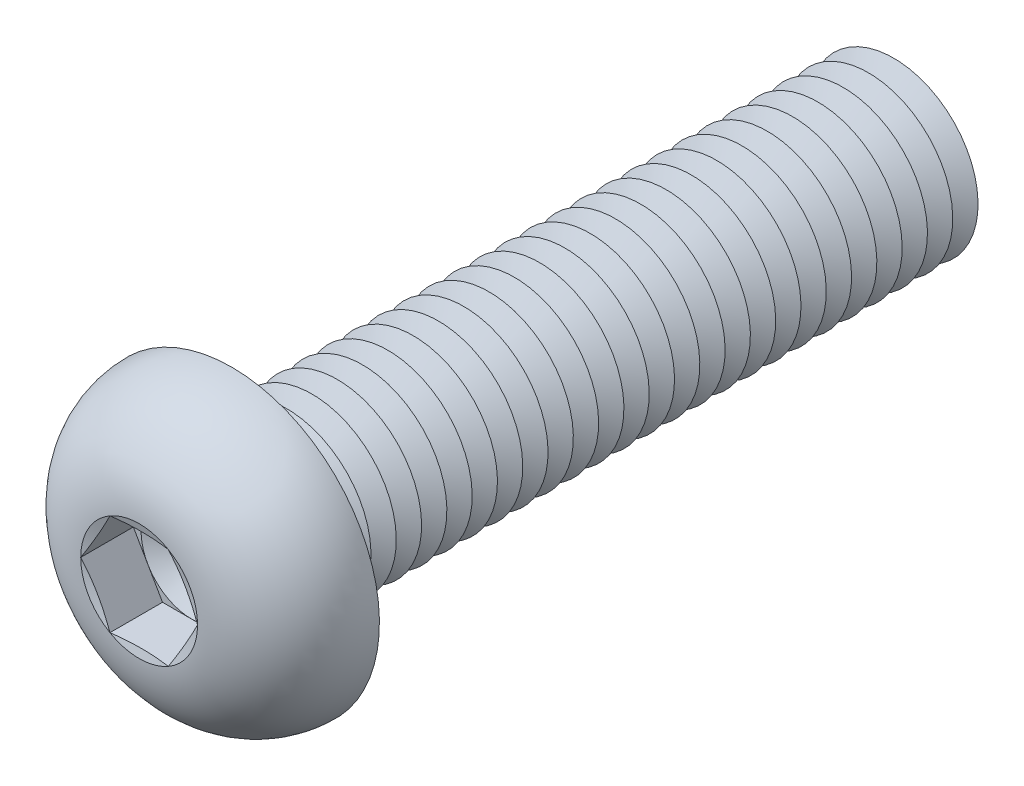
from build123d import *

# Parameters (mm, degrees)
FILLET1_R          = 0.75
LPATTERN1_COUNT    = 26
LPATTERN1_PITCH    = 1.5
CUT_EXTRUDE1_DEPTH = 3.12


with BuildPart() as part:
    # Sketch1 → Revolve1 (revolve)
    with BuildSketch(Plane(origin=(0, 0, 0), x_dir=(0, 0, -1), z_dir=(1, 0, 0))):
        with BuildLine():
            Line((0, 5), (0, 8.75))
            ThreePointArc((0, 8.75), (-3.814142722, 7.21429474), (-5.5, 3.4641))
            Line((-5.5, 3.4641), (-5.035898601, 1.73205))
            Line((-5.035898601, 1.73205), (-5.5, 1.73205))
            Line((-5.5, 1.73205), (-5.5, 0))
            Line((-5.5, 0), (40, 0))
            Line((40, 0), (40, 5))
            Line((40, 5), (0, 5))
        make_face()
    revolve(axis=Axis((0, 0, -40), (0, 0, 1)))

    # Fillet1
    fillet1_edges = [part.edges().sort_by_distance(p)[0] for p in [
        (0, -5, 0),
    ]]
    fillet(fillet1_edges, radius=FILLET1_R)

    # Sketch2 → Cut-Revolve1 (revolve, cut)
    with BuildSketch(Plane(origin=(0, 0, 0), x_dir=(0, 0, -1), z_dir=(1, 0, 0))):
        Polygon((39.25, 5), (40.75, 5), (40, 3.700961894), align=None)
    cut_revolve1 = revolve(axis=Axis((0, 0, -40), (0, 0, -1)), mode=Mode.SUBTRACT)

    # LPattern1: Cut-Revolve1 ×26
    with Locations(*[(0, 0, i * LPATTERN1_PITCH) for i in range(1, LPATTERN1_COUNT)]):
        add(cut_revolve1, mode=Mode.SUBTRACT)

    # Sketch3 → Cut-Extrude1 (cut)
    with BuildSketch(Plane.XY.offset(5.5)):
        Polygon((1.73205, 2.999998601), (-1.73205, 2.999998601), (-3.4641, 0), (-1.73205, -2.999998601), (1.73205, -2.999998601), (3.4641, 0), align=None)
    extrude(amount=-CUT_EXTRUDE1_DEPTH, mode=Mode.SUBTRACT)

    # Cut-Extrude2 cone 1 section (on through the dimple's axis) → Cut-Extrude2 (revolve, cut)
    with BuildSketch(Plane(origin=(0, 0, 2.38), x_dir=(0, -1, 0), z_dir=(1, 0, 0))):
        Polygon((0, 0), (2.999998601, 0), (0, 1.73205), align=None)
    revolve(axis=Axis((0, 0, 2.38), (0, 0, -1)), mode=Mode.SUBTRACT)


solid = part.part
